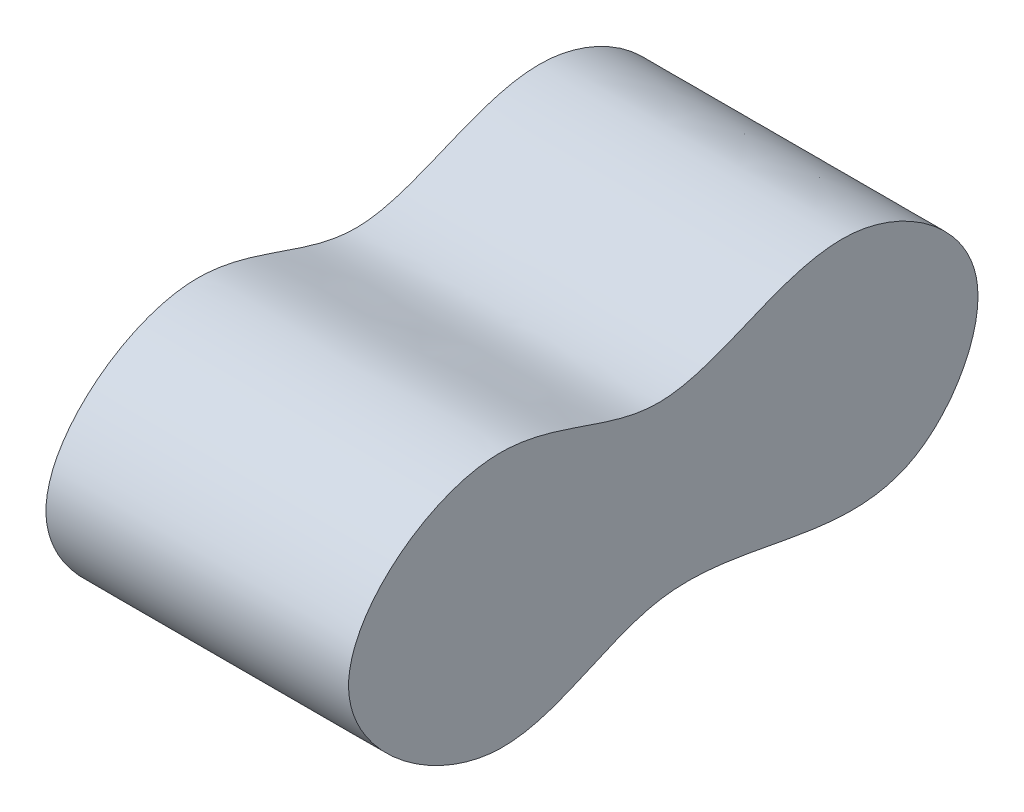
from build123d import *

# Parameters (mm, degrees)
BOSS_EXTRUDE1_DEPTH = 50


with BuildPart() as part:
    # Sketch1 → Boss-Extrude1 (new, symmetric)
    with BuildSketch(Plane(origin=(0, 0, 0), x_dir=(0, 0, -1), z_dir=(1, 0, 0))):
        with BuildLine():
            add(Edge.make_bspline(
                [(-56.039206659, 47.677335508), (-78.012616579, 45.915562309), (-128.41144435, 5.565439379), (-52.959671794, -53.900245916), (6.072898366, -2.66117095), (78.849573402, -46.432688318), (118.878466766, 23.753894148), (57.685065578, 69.098381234), (2.766836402, 20.312788), (-35.861813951, 49.295108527), (-56.039206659, 47.677335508)],
                knots=[0, 0, 0, 0, 0.127336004, 0.261095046, 0.375018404, 0.549386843, 0.638619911, 0.748787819, 0.883071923, 1, 1, 1, 1], degree=3))
        make_face()
    extrude(amount=BOSS_EXTRUDE1_DEPTH, both=True)


solid = part.part
